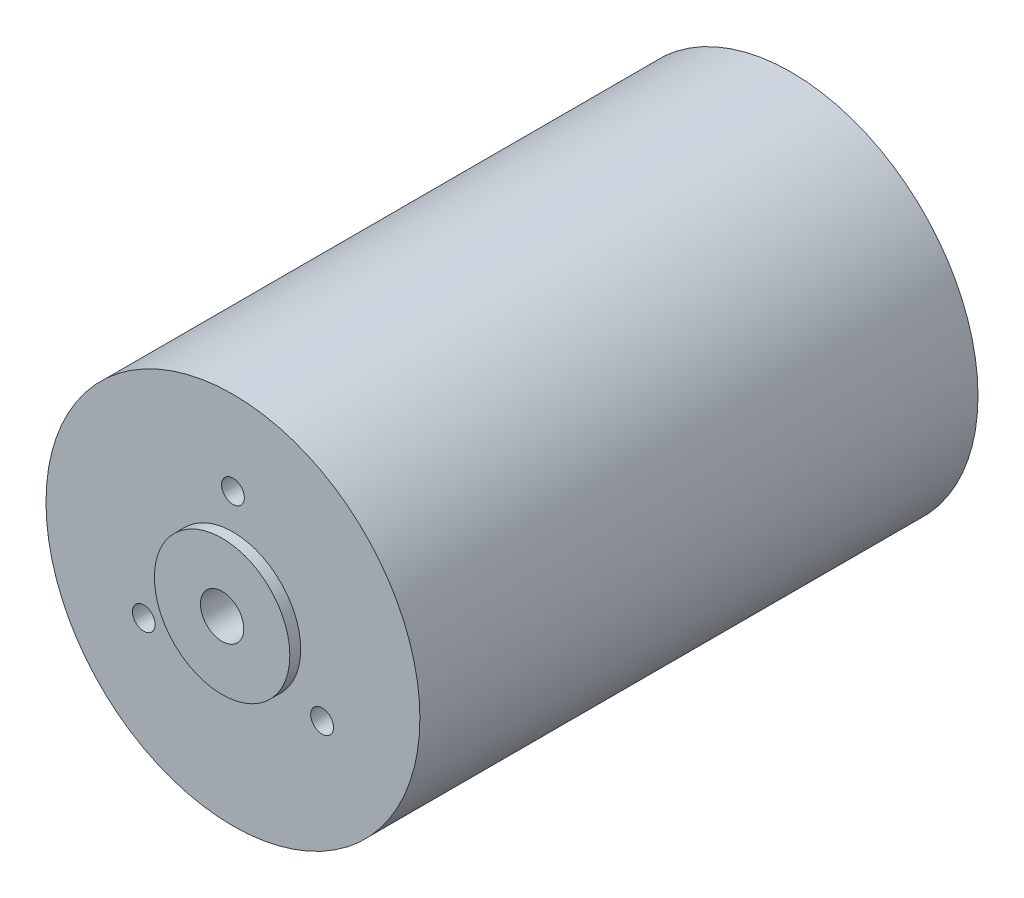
ISO-10303-21;
HEADER;
FILE_DESCRIPTION(('STEP AP214'),'2;1');
FILE_NAME('part.step','',(''),(''),'','','');
FILE_SCHEMA(('AUTOMOTIVE_DESIGN { 1 0 10303 214 1 1 1 1 }'));
ENDSEC;
DATA;
#1=APPLICATION_CONTEXT('core data for automotive mechanical design processes');
#2=APPLICATION_PROTOCOL_DEFINITION('international standard','automotive_design',2000,#1);
#3=PRODUCT_CONTEXT('',#1,'mechanical');
#4=PRODUCT('Part','Part','',(#3));
#5=PRODUCT_RELATED_PRODUCT_CATEGORY('part','',(#4));
#6=PRODUCT_DEFINITION_FORMATION('','',#4);
#7=PRODUCT_DEFINITION_CONTEXT('part definition',#1,'design');
#8=PRODUCT_DEFINITION('design','',#6,#7);
#9=PRODUCT_DEFINITION_SHAPE('','',#8);
#10=(LENGTH_UNIT() NAMED_UNIT(*) SI_UNIT(.MILLI.,.METRE.));
#11=(NAMED_UNIT(*) PLANE_ANGLE_UNIT() SI_UNIT($,.RADIAN.));
#12=(NAMED_UNIT(*) SI_UNIT($,.STERADIAN.) SOLID_ANGLE_UNIT());
#13=UNCERTAINTY_MEASURE_WITH_UNIT(LENGTH_MEASURE(1.E-05),#10,'distance_accuracy_value','');
#14=(GEOMETRIC_REPRESENTATION_CONTEXT(3) GLOBAL_UNCERTAINTY_ASSIGNED_CONTEXT((#13)) GLOBAL_UNIT_ASSIGNED_CONTEXT((#10,
#11,#12)) REPRESENTATION_CONTEXT('',''));
#15=CARTESIAN_POINT('',(0.,0.,0.));
#16=DIRECTION('',(0.,0.,1.));
#17=DIRECTION('',(1.,0.,0.));
#18=AXIS2_PLACEMENT_3D('',#15,#16,#17);
#19=CARTESIAN_POINT('',(0.,0.,103.));
#20=DIRECTION('',(0.,0.,1.));
#21=DIRECTION('',(1.,0.,0.));
#22=AXIS2_PLACEMENT_3D('',#19,#20,#21);
#23=PLANE('',#22);
#24=CARTESIAN_POINT('',(-16.4544826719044,-9.49999999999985,103.));
#25=DIRECTION('',(0.,0.,1.));
#26=DIRECTION('',(1.,0.,0.));
#27=AXIS2_PLACEMENT_3D('',#24,#25,#26);
#28=CIRCLE('',#27,2.1);
#29=CARTESIAN_POINT('',(-14.3544826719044,-9.49999999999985,103.));
#30=VERTEX_POINT('',#29);
#31=EDGE_CURVE('E60',#30,#30,#28,.T.);
#32=ORIENTED_EDGE('',*,*,#31,.F.);
#33=EDGE_LOOP('',(#32));
#34=FACE_BOUND('',#33,.T.);
#35=CARTESIAN_POINT('',(16.4544826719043,-9.50000000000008,103.));
#36=DIRECTION('',(0.,0.,1.));
#37=DIRECTION('',(1.,0.,0.));
#38=AXIS2_PLACEMENT_3D('',#35,#36,#37);
#39=CIRCLE('',#38,2.1);
#40=CARTESIAN_POINT('',(18.5544826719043,-9.50000000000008,103.));
#41=VERTEX_POINT('',#40);
#42=EDGE_CURVE('E68',#41,#41,#39,.T.);
#43=ORIENTED_EDGE('',*,*,#42,.F.);
#44=EDGE_LOOP('',(#43));
#45=FACE_BOUND('',#44,.T.);
#46=CARTESIAN_POINT('',(0.,19.,103.));
#47=DIRECTION('',(0.,0.,1.));
#48=DIRECTION('',(1.,0.,0.));
#49=AXIS2_PLACEMENT_3D('',#46,#47,#48);
#50=CIRCLE('',#49,2.1);
#51=CARTESIAN_POINT('',(2.1,19.,103.));
#52=VERTEX_POINT('',#51);
#53=EDGE_CURVE('E74',#52,#52,#50,.T.);
#54=ORIENTED_EDGE('',*,*,#53,.F.);
#55=EDGE_LOOP('',(#54));
#56=FACE_BOUND('',#55,.T.);
#57=CARTESIAN_POINT('',(0.,0.,103.));
#58=DIRECTION('',(0.,0.,1.));
#59=DIRECTION('',(1.,0.,0.));
#60=AXIS2_PLACEMENT_3D('',#57,#58,#59);
#61=CIRCLE('',#60,34.5);
#62=CARTESIAN_POINT('',(34.5,0.,103.));
#63=VERTEX_POINT('',#62);
#64=EDGE_CURVE('E41',#63,#63,#61,.T.);
#65=ORIENTED_EDGE('',*,*,#64,.T.);
#66=EDGE_LOOP('',(#65));
#67=FACE_BOUND('',#66,.T.);
#68=CARTESIAN_POINT('',(0.,0.,103.));
#69=DIRECTION('',(0.,0.,1.));
#70=DIRECTION('',(1.,0.,0.));
#71=AXIS2_PLACEMENT_3D('',#68,#69,#70);
#72=CIRCLE('',#71,12.5);
#73=CARTESIAN_POINT('',(12.5,0.,103.));
#74=VERTEX_POINT('',#73);
#75=EDGE_CURVE('E81',#74,#74,#72,.T.);
#76=ORIENTED_EDGE('',*,*,#75,.F.);
#77=EDGE_LOOP('',(#76));
#78=FACE_BOUND('',#77,.T.);
#79=ADVANCED_FACE('F33',(#34,#45,#56,#67,#78),#23,.T.);
#80=CARTESIAN_POINT('',(0.,0.,0.));
#81=DIRECTION('',(0.,0.,1.));
#82=DIRECTION('',(1.,0.,0.));
#83=AXIS2_PLACEMENT_3D('',#80,#81,#82);
#84=PLANE('',#83);
#85=CARTESIAN_POINT('',(0.,0.,0.));
#86=DIRECTION('',(0.,0.,1.));
#87=DIRECTION('',(1.,0.,0.));
#88=AXIS2_PLACEMENT_3D('',#85,#86,#87);
#89=CIRCLE('',#88,34.5);
#90=CARTESIAN_POINT('',(34.5,0.,0.));
#91=VERTEX_POINT('',#90);
#92=EDGE_CURVE('E92',#91,#91,#89,.T.);
#93=ORIENTED_EDGE('',*,*,#92,.F.);
#94=EDGE_LOOP('',(#93));
#95=FACE_BOUND('',#94,.T.);
#96=CARTESIAN_POINT('',(0.,0.,0.));
#97=DIRECTION('',(0.,0.,1.));
#98=DIRECTION('',(1.,0.,0.));
#99=AXIS2_PLACEMENT_3D('',#96,#97,#98);
#100=CIRCLE('',#99,14.);
#101=CARTESIAN_POINT('',(14.,0.,0.));
#102=VERTEX_POINT('',#101);
#103=EDGE_CURVE('E11',#102,#102,#100,.F.);
#104=ORIENTED_EDGE('',*,*,#103,.F.);
#105=EDGE_LOOP('',(#104));
#106=FACE_BOUND('',#105,.T.);
#107=ADVANCED_FACE('F98',(#95,#106),#84,.F.);
#108=CARTESIAN_POINT('',(0.,0.,103.));
#109=DIRECTION('',(0.,0.,-1.));
#110=DIRECTION('',(-1.,0.,0.));
#111=AXIS2_PLACEMENT_3D('',#108,#109,#110);
#112=CYLINDRICAL_SURFACE('',#111,34.5);
#113=ORIENTED_EDGE('',*,*,#64,.F.);
#114=EDGE_LOOP('',(#113));
#115=FACE_BOUND('',#114,.T.);
#116=ORIENTED_EDGE('',*,*,#92,.T.);
#117=EDGE_LOOP('',(#116));
#118=FACE_BOUND('',#117,.T.);
#119=ADVANCED_FACE('F35',(#115,#118),#112,.T.);
#120=CARTESIAN_POINT('',(0.,0.,-8.));
#121=DIRECTION('',(0.,0.,1.));
#122=DIRECTION('',(1.,0.,0.));
#123=AXIS2_PLACEMENT_3D('',#120,#121,#122);
#124=CYLINDRICAL_SURFACE('',#123,14.);
#125=CARTESIAN_POINT('',(0.,0.,-8.));
#126=DIRECTION('',(0.,0.,-1.));
#127=DIRECTION('',(-1.,0.,0.));
#128=AXIS2_PLACEMENT_3D('',#125,#126,#127);
#129=CIRCLE('',#128,14.);
#130=CARTESIAN_POINT('',(-14.,0.,-8.));
#131=VERTEX_POINT('',#130);
#132=EDGE_CURVE('E87',#131,#131,#129,.T.);
#133=ORIENTED_EDGE('',*,*,#132,.F.);
#134=EDGE_LOOP('',(#133));
#135=FACE_BOUND('',#134,.T.);
#136=ORIENTED_EDGE('',*,*,#103,.T.);
#137=EDGE_LOOP('',(#136));
#138=FACE_BOUND('',#137,.T.);
#139=ADVANCED_FACE('F103',(#135,#138),#124,.T.);
#140=CARTESIAN_POINT('',(0.,0.,-8.));
#141=DIRECTION('',(0.,0.,-1.));
#142=DIRECTION('',(-1.,0.,0.));
#143=AXIS2_PLACEMENT_3D('',#140,#141,#142);
#144=PLANE('',#143);
#145=ORIENTED_EDGE('',*,*,#132,.T.);
#146=EDGE_LOOP('',(#145));
#147=FACE_BOUND('',#146,.T.);
#148=ADVANCED_FACE('F105',(#147),#144,.T.);
#149=CARTESIAN_POINT('',(0.,0.,105.));
#150=DIRECTION('',(0.,0.,-1.));
#151=DIRECTION('',(-1.,0.,0.));
#152=AXIS2_PLACEMENT_3D('',#149,#150,#151);
#153=CYLINDRICAL_SURFACE('',#152,12.5);
#154=CARTESIAN_POINT('',(0.,0.,105.));
#155=DIRECTION('',(0.,0.,1.));
#156=DIRECTION('',(1.,0.,0.));
#157=AXIS2_PLACEMENT_3D('',#154,#155,#156);
#158=CIRCLE('',#157,12.5);
#159=CARTESIAN_POINT('',(12.5,0.,105.));
#160=VERTEX_POINT('',#159);
#161=EDGE_CURVE('E84',#160,#160,#158,.T.);
#162=ORIENTED_EDGE('',*,*,#161,.F.);
#163=EDGE_LOOP('',(#162));
#164=FACE_BOUND('',#163,.T.);
#165=ORIENTED_EDGE('',*,*,#75,.T.);
#166=EDGE_LOOP('',(#165));
#167=FACE_BOUND('',#166,.T.);
#168=ADVANCED_FACE('F112',(#164,#167),#153,.T.);
#169=CARTESIAN_POINT('',(0.,0.,105.));
#170=DIRECTION('',(0.,0.,1.));
#171=DIRECTION('',(1.,0.,0.));
#172=AXIS2_PLACEMENT_3D('',#169,#170,#171);
#173=PLANE('',#172);
#174=CARTESIAN_POINT('',(0.,0.,105.));
#175=DIRECTION('',(0.,0.,1.));
#176=DIRECTION('',(1.,0.,0.));
#177=AXIS2_PLACEMENT_3D('',#174,#175,#176);
#178=CIRCLE('',#177,4.);
#179=CARTESIAN_POINT('',(4.,0.,105.));
#180=VERTEX_POINT('',#179);
#181=EDGE_CURVE('E77',#180,#180,#178,.T.);
#182=ORIENTED_EDGE('',*,*,#181,.F.);
#183=EDGE_LOOP('',(#182));
#184=FACE_BOUND('',#183,.T.);
#185=ORIENTED_EDGE('',*,*,#161,.T.);
#186=EDGE_LOOP('',(#185));
#187=FACE_BOUND('',#186,.T.);
#188=ADVANCED_FACE('F133',(#184,#187),#173,.T.);
#189=CARTESIAN_POINT('',(0.,0.,91.5));
#190=DIRECTION('',(0.,0.,1.));
#191=DIRECTION('',(1.,0.,0.));
#192=AXIS2_PLACEMENT_3D('',#189,#190,#191);
#193=CYLINDRICAL_SURFACE('',#192,4.);
#194=CARTESIAN_POINT('',(0.,0.,91.5));
#195=DIRECTION('',(0.,0.,1.));
#196=DIRECTION('',(1.,0.,0.));
#197=AXIS2_PLACEMENT_3D('',#194,#195,#196);
#198=CIRCLE('',#197,4.);
#199=CARTESIAN_POINT('',(4.,0.,91.5));
#200=VERTEX_POINT('',#199);
#201=EDGE_CURVE('E78',#200,#200,#198,.T.);
#202=ORIENTED_EDGE('',*,*,#201,.F.);
#203=EDGE_LOOP('',(#202));
#204=FACE_BOUND('',#203,.T.);
#205=ORIENTED_EDGE('',*,*,#181,.T.);
#206=EDGE_LOOP('',(#205));
#207=FACE_BOUND('',#206,.T.);
#208=ADVANCED_FACE('F139',(#204,#207),#193,.F.);
#209=CARTESIAN_POINT('',(0.,0.,91.5));
#210=DIRECTION('',(0.,0.,1.));
#211=DIRECTION('',(1.,0.,0.));
#212=AXIS2_PLACEMENT_3D('',#209,#210,#211);
#213=PLANE('',#212);
#214=ORIENTED_EDGE('',*,*,#201,.T.);
#215=EDGE_LOOP('',(#214));
#216=FACE_BOUND('',#215,.T.);
#217=ADVANCED_FACE('F146',(#216),#213,.T.);
#218=CARTESIAN_POINT('',(0.,19.,103.));
#219=DIRECTION('',(0.,0.,1.));
#220=DIRECTION('',(1.,0.,0.));
#221=AXIS2_PLACEMENT_3D('',#218,#219,#220);
#222=CYLINDRICAL_SURFACE('',#221,2.1);
#223=CARTESIAN_POINT('',(0.,19.,89.));
#224=DIRECTION('',(0.,0.,1.));
#225=DIRECTION('',(1.,0.,0.));
#226=AXIS2_PLACEMENT_3D('',#223,#224,#225);
#227=CIRCLE('',#226,2.1);
#228=CARTESIAN_POINT('',(2.1,19.,89.));
#229=VERTEX_POINT('',#228);
#230=EDGE_CURVE('E71',#229,#229,#227,.T.);
#231=ORIENTED_EDGE('',*,*,#230,.F.);
#232=EDGE_LOOP('',(#231));
#233=FACE_BOUND('',#232,.T.);
#234=ORIENTED_EDGE('',*,*,#53,.T.);
#235=EDGE_LOOP('',(#234));
#236=FACE_BOUND('',#235,.T.);
#237=ADVANCED_FACE('F150',(#233,#236),#222,.F.);
#238=CARTESIAN_POINT('',(0.,19.,89.));
#239=DIRECTION('',(0.,0.,1.));
#240=DIRECTION('',(1.,0.,0.));
#241=AXIS2_PLACEMENT_3D('',#238,#239,#240);
#242=CONICAL_SURFACE('',#241,2.1,1.02974425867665);
#243=CARTESIAN_POINT('',(0.,19.,87.7381927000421));
#244=VERTEX_POINT('',#243);
#245=VERTEX_LOOP('',#244);
#246=FACE_BOUND('',#245,.T.);
#247=ORIENTED_EDGE('',*,*,#230,.T.);
#248=EDGE_LOOP('',(#247));
#249=FACE_BOUND('',#248,.T.);
#250=ADVANCED_FACE('F154',(#246,#249),#242,.F.);
#251=CARTESIAN_POINT('',(16.4544826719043,-9.50000000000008,103.));
#252=DIRECTION('',(0.,0.,1.));
#253=DIRECTION('',(1.,0.,0.));
#254=AXIS2_PLACEMENT_3D('',#251,#252,#253);
#255=CYLINDRICAL_SURFACE('',#254,2.1);
#256=CARTESIAN_POINT('',(16.4544826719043,-9.50000000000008,89.));
#257=DIRECTION('',(0.,0.,1.));
#258=DIRECTION('',(1.,0.,0.));
#259=AXIS2_PLACEMENT_3D('',#256,#257,#258);
#260=CIRCLE('',#259,2.1);
#261=CARTESIAN_POINT('',(18.5544826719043,-9.50000000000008,89.));
#262=VERTEX_POINT('',#261);
#263=EDGE_CURVE('E63',#262,#262,#260,.T.);
#264=ORIENTED_EDGE('',*,*,#263,.F.);
#265=EDGE_LOOP('',(#264));
#266=FACE_BOUND('',#265,.T.);
#267=ORIENTED_EDGE('',*,*,#42,.T.);
#268=EDGE_LOOP('',(#267));
#269=FACE_BOUND('',#268,.T.);
#270=ADVANCED_FACE('F158',(#266,#269),#255,.F.);
#271=CARTESIAN_POINT('',(16.4544826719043,-9.50000000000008,89.));
#272=DIRECTION('',(0.,0.,1.));
#273=DIRECTION('',(1.,0.,0.));
#274=AXIS2_PLACEMENT_3D('',#271,#272,#273);
#275=CONICAL_SURFACE('',#274,2.1,1.02974425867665);
#276=CARTESIAN_POINT('',(16.4544826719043,-9.50000000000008,87.7381927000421));
#277=VERTEX_POINT('',#276);
#278=VERTEX_LOOP('',#277);
#279=FACE_BOUND('',#278,.T.);
#280=ORIENTED_EDGE('',*,*,#263,.T.);
#281=EDGE_LOOP('',(#280));
#282=FACE_BOUND('',#281,.T.);
#283=ADVANCED_FACE('F161',(#279,#282),#275,.F.);
#284=CARTESIAN_POINT('',(-16.4544826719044,-9.49999999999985,103.));
#285=DIRECTION('',(0.,0.,1.));
#286=DIRECTION('',(1.,0.,0.));
#287=AXIS2_PLACEMENT_3D('',#284,#285,#286);
#288=CYLINDRICAL_SURFACE('',#287,2.1);
#289=CARTESIAN_POINT('',(-16.4544826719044,-9.49999999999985,89.));
#290=DIRECTION('',(0.,0.,1.));
#291=DIRECTION('',(1.,0.,0.));
#292=AXIS2_PLACEMENT_3D('',#289,#290,#291);
#293=CIRCLE('',#292,2.1);
#294=CARTESIAN_POINT('',(-14.3544826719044,-9.49999999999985,89.));
#295=VERTEX_POINT('',#294);
#296=EDGE_CURVE('E58',#295,#295,#293,.T.);
#297=ORIENTED_EDGE('',*,*,#296,.F.);
#298=EDGE_LOOP('',(#297));
#299=FACE_BOUND('',#298,.T.);
#300=ORIENTED_EDGE('',*,*,#31,.T.);
#301=EDGE_LOOP('',(#300));
#302=FACE_BOUND('',#301,.T.);
#303=ADVANCED_FACE('F54',(#299,#302),#288,.F.);
#304=CARTESIAN_POINT('',(-16.4544826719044,-9.49999999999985,89.));
#305=DIRECTION('',(0.,0.,1.));
#306=DIRECTION('',(1.,0.,0.));
#307=AXIS2_PLACEMENT_3D('',#304,#305,#306);
#308=CONICAL_SURFACE('',#307,2.1,1.02974425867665);
#309=CARTESIAN_POINT('',(-16.4544826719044,-9.49999999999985,87.7381927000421));
#310=VERTEX_POINT('',#309);
#311=VERTEX_LOOP('',#310);
#312=FACE_BOUND('',#311,.T.);
#313=ORIENTED_EDGE('',*,*,#296,.T.);
#314=EDGE_LOOP('',(#313));
#315=FACE_BOUND('',#314,.T.);
#316=ADVANCED_FACE('F51',(#312,#315),#308,.F.);
#317=CLOSED_SHELL('',(#79,#107,#119,#139,#148,#168,#188,#208,#217,#237,#250,#270,#283,#303,#316));
#318=MANIFOLD_SOLID_BREP('B2',#317);
#319=ADVANCED_BREP_SHAPE_REPRESENTATION('',(#18,#318),#14);
#320=SHAPE_DEFINITION_REPRESENTATION(#9,#319);
ENDSEC;
END-ISO-10303-21;
